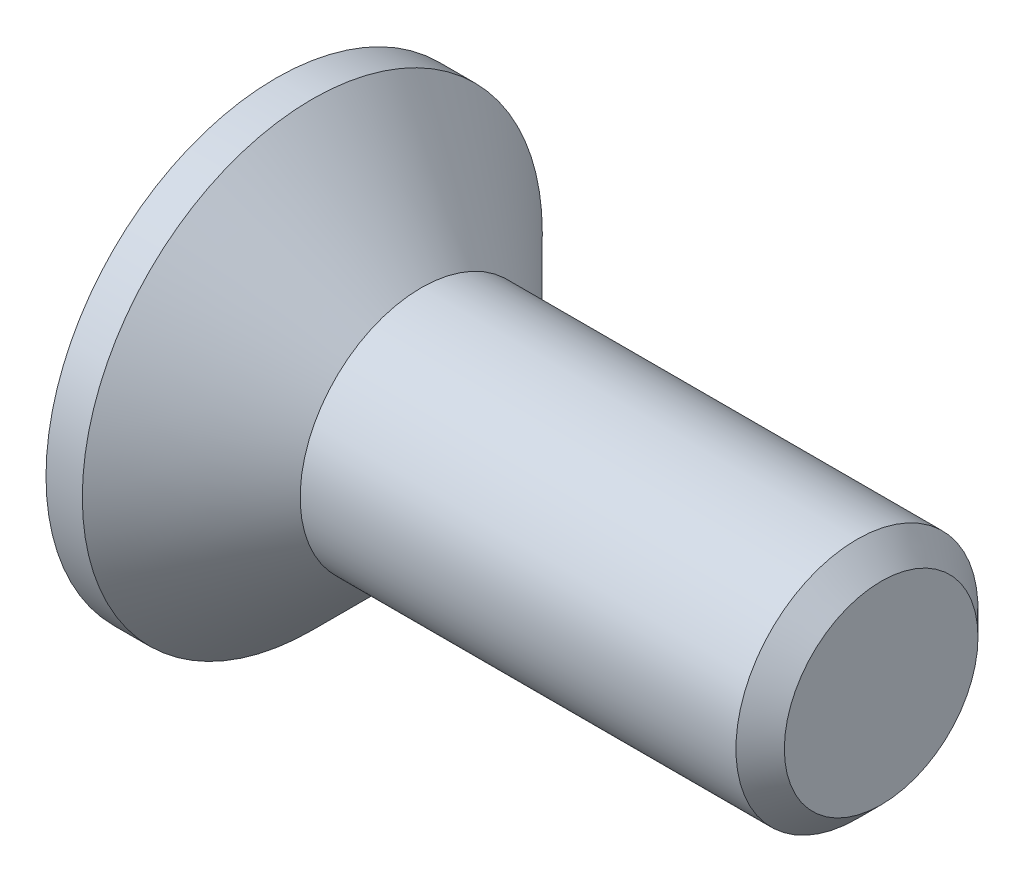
ISO-10303-21;
HEADER;
FILE_DESCRIPTION(('STEP AP214'),'2;1');
FILE_NAME('part.step','',(''),(''),'','','');
FILE_SCHEMA(('AUTOMOTIVE_DESIGN { 1 0 10303 214 1 1 1 1 }'));
ENDSEC;
DATA;
#1=APPLICATION_CONTEXT('core data for automotive mechanical design processes');
#2=APPLICATION_PROTOCOL_DEFINITION('international standard','automotive_design',2000,#1);
#3=PRODUCT_CONTEXT('',#1,'mechanical');
#4=PRODUCT('Part','Part','',(#3));
#5=PRODUCT_RELATED_PRODUCT_CATEGORY('part','',(#4));
#6=PRODUCT_DEFINITION_FORMATION('','',#4);
#7=PRODUCT_DEFINITION_CONTEXT('part definition',#1,'design');
#8=PRODUCT_DEFINITION('design','',#6,#7);
#9=PRODUCT_DEFINITION_SHAPE('','',#8);
#10=(LENGTH_UNIT() NAMED_UNIT(*) SI_UNIT(.MILLI.,.METRE.));
#11=(NAMED_UNIT(*) PLANE_ANGLE_UNIT() SI_UNIT($,.RADIAN.));
#12=(NAMED_UNIT(*) SI_UNIT($,.STERADIAN.) SOLID_ANGLE_UNIT());
#13=UNCERTAINTY_MEASURE_WITH_UNIT(LENGTH_MEASURE(1.E-05),#10,'distance_accuracy_value','');
#14=(GEOMETRIC_REPRESENTATION_CONTEXT(3) GLOBAL_UNCERTAINTY_ASSIGNED_CONTEXT((#13)) GLOBAL_UNIT_ASSIGNED_CONTEXT((#10,
#11,#12)) REPRESENTATION_CONTEXT('',''));
#15=CARTESIAN_POINT('',(0.,0.,0.));
#16=DIRECTION('',(0.,0.,1.));
#17=DIRECTION('',(1.,0.,0.));
#18=AXIS2_PLACEMENT_3D('',#15,#16,#17);
#19=CARTESIAN_POINT('',(0.,0.,0.));
#20=DIRECTION('',(-1.,0.,0.));
#21=DIRECTION('',(0.,-1.,0.));
#22=AXIS2_PLACEMENT_3D('',#19,#20,#21);
#23=CONICAL_SURFACE('',#22,1.,0.78539816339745);
#24=CARTESIAN_POINT('',(-0.899999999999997,0.,0.));
#25=DIRECTION('',(-1.,0.,0.));
#26=DIRECTION('',(0.,-1.,0.));
#27=AXIS2_PLACEMENT_3D('',#24,#25,#26);
#28=CIRCLE('',#27,1.9);
#29=CARTESIAN_POINT('',(-0.899999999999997,-1.9,0.));
#30=VERTEX_POINT('',#29);
#31=EDGE_CURVE('E189',#30,#30,#28,.T.);
#32=ORIENTED_EDGE('',*,*,#31,.F.);
#33=EDGE_LOOP('',(#32));
#34=FACE_BOUND('',#33,.T.);
#35=CARTESIAN_POINT('',(0.,0.,0.));
#36=DIRECTION('',(-1.,0.,0.));
#37=DIRECTION('',(0.,-1.,0.));
#38=AXIS2_PLACEMENT_3D('',#35,#36,#37);
#39=CIRCLE('',#38,1.);
#40=CARTESIAN_POINT('',(0.,-1.,0.));
#41=VERTEX_POINT('',#40);
#42=EDGE_CURVE('E212',#41,#41,#39,.T.);
#43=ORIENTED_EDGE('',*,*,#42,.T.);
#44=EDGE_LOOP('',(#43));
#45=FACE_BOUND('',#44,.T.);
#46=ADVANCED_FACE('F33',(#34,#45),#23,.T.);
#47=CARTESIAN_POINT('',(-1.2,0.,0.));
#48=DIRECTION('',(-1.,0.,0.));
#49=DIRECTION('',(0.,-1.,0.));
#50=AXIS2_PLACEMENT_3D('',#47,#48,#49);
#51=CYLINDRICAL_SURFACE('',#50,1.);
#52=CARTESIAN_POINT('',(3.6,0.,0.));
#53=DIRECTION('',(-1.,0.,0.));
#54=DIRECTION('',(0.,-1.,0.));
#55=AXIS2_PLACEMENT_3D('',#52,#53,#54);
#56=CIRCLE('',#55,1.);
#57=CARTESIAN_POINT('',(3.6,-1.,0.));
#58=VERTEX_POINT('',#57);
#59=EDGE_CURVE('E41',#58,#58,#56,.T.);
#60=ORIENTED_EDGE('',*,*,#59,.T.);
#61=EDGE_LOOP('',(#60));
#62=FACE_BOUND('',#61,.T.);
#63=ORIENTED_EDGE('',*,*,#42,.F.);
#64=EDGE_LOOP('',(#63));
#65=FACE_BOUND('',#64,.T.);
#66=ADVANCED_FACE('F217',(#62,#65),#51,.T.);
#67=CARTESIAN_POINT('',(3.8,0.,0.));
#68=DIRECTION('',(-1.,0.,0.));
#69=DIRECTION('',(0.,-1.,0.));
#70=AXIS2_PLACEMENT_3D('',#67,#68,#69);
#71=PLANE('',#70);
#72=CARTESIAN_POINT('',(3.8,0.,0.));
#73=DIRECTION('',(-1.,0.,0.));
#74=DIRECTION('',(0.,-1.,0.));
#75=AXIS2_PLACEMENT_3D('',#72,#73,#74);
#76=CIRCLE('',#75,0.799999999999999);
#77=CARTESIAN_POINT('',(3.8,-0.799999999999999,0.));
#78=VERTEX_POINT('',#77);
#79=EDGE_CURVE('E11',#78,#78,#76,.F.);
#80=ORIENTED_EDGE('',*,*,#79,.T.);
#81=EDGE_LOOP('',(#80));
#82=FACE_BOUND('',#81,.T.);
#83=ADVANCED_FACE('F239',(#82),#71,.F.);
#84=CARTESIAN_POINT('',(-1.2,1.9,0.));
#85=DIRECTION('',(1.,0.,0.));
#86=DIRECTION('',(0.,1.,0.));
#87=AXIS2_PLACEMENT_3D('',#84,#85,#86);
#88=PLANE('',#87);
#89=DIRECTION('',(0.,0.,-1.));
#90=VECTOR('',#89,1.);
#91=CARTESIAN_POINT('',(-1.2,0.3,-1.175));
#92=LINE('',#91,#90);
#93=CARTESIAN_POINT('',(-1.2,0.3,-0.3));
#94=VERTEX_POINT('',#93);
#95=CARTESIAN_POINT('',(-1.2,0.3,-1.175));
#96=VERTEX_POINT('',#95);
#97=EDGE_CURVE('E158',#94,#96,#92,.T.);
#98=ORIENTED_EDGE('',*,*,#97,.F.);
#99=DIRECTION('',(0.,-1.,0.));
#100=VECTOR('',#99,1.);
#101=CARTESIAN_POINT('',(-1.2,0.3,-0.3));
#102=LINE('',#101,#100);
#103=CARTESIAN_POINT('',(-1.2,1.175,-0.3));
#104=VERTEX_POINT('',#103);
#105=EDGE_CURVE('E48',#104,#94,#102,.T.);
#106=ORIENTED_EDGE('',*,*,#105,.F.);
#107=DIRECTION('',(0.,0.,-1.));
#108=VECTOR('',#107,1.);
#109=CARTESIAN_POINT('',(-1.2,1.175,-0.3));
#110=LINE('',#109,#108);
#111=CARTESIAN_POINT('',(-1.2,1.175,0.3));
#112=VERTEX_POINT('',#111);
#113=EDGE_CURVE('E185',#112,#104,#110,.T.);
#114=ORIENTED_EDGE('',*,*,#113,.F.);
#115=DIRECTION('',(0.,1.,0.));
#116=VECTOR('',#115,1.);
#117=CARTESIAN_POINT('',(-1.2,1.175,0.3));
#118=LINE('',#117,#116);
#119=CARTESIAN_POINT('',(-1.2,0.3,0.3));
#120=VERTEX_POINT('',#119);
#121=EDGE_CURVE('E183',#120,#112,#118,.T.);
#122=ORIENTED_EDGE('',*,*,#121,.F.);
#123=DIRECTION('',(0.,0.,-1.));
#124=VECTOR('',#123,1.);
#125=CARTESIAN_POINT('',(-1.2,0.3,0.3));
#126=LINE('',#125,#124);
#127=CARTESIAN_POINT('',(-1.2,0.3,1.175));
#128=VERTEX_POINT('',#127);
#129=EDGE_CURVE('E132',#128,#120,#126,.T.);
#130=ORIENTED_EDGE('',*,*,#129,.F.);
#131=DIRECTION('',(0.,1.,0.));
#132=VECTOR('',#131,1.);
#133=CARTESIAN_POINT('',(-1.2,0.3,1.175));
#134=LINE('',#133,#132);
#135=CARTESIAN_POINT('',(-1.2,-0.3,1.175));
#136=VERTEX_POINT('',#135);
#137=EDGE_CURVE('E179',#136,#128,#134,.T.);
#138=ORIENTED_EDGE('',*,*,#137,.F.);
#139=DIRECTION('',(0.,0.,1.));
#140=VECTOR('',#139,1.);
#141=CARTESIAN_POINT('',(-1.2,-0.3,1.175));
#142=LINE('',#141,#140);
#143=CARTESIAN_POINT('',(-1.2,-0.3,0.3));
#144=VERTEX_POINT('',#143);
#145=EDGE_CURVE('E176',#144,#136,#142,.T.);
#146=ORIENTED_EDGE('',*,*,#145,.F.);
#147=DIRECTION('',(0.,1.,0.));
#148=VECTOR('',#147,1.);
#149=CARTESIAN_POINT('',(-1.2,-0.3,0.3));
#150=LINE('',#149,#148);
#151=CARTESIAN_POINT('',(-1.2,-1.175,0.3));
#152=VERTEX_POINT('',#151);
#153=EDGE_CURVE('E173',#152,#144,#150,.T.);
#154=ORIENTED_EDGE('',*,*,#153,.F.);
#155=DIRECTION('',(0.,0.,1.));
#156=VECTOR('',#155,1.);
#157=CARTESIAN_POINT('',(-1.2,-1.175,0.3));
#158=LINE('',#157,#156);
#159=CARTESIAN_POINT('',(-1.2,-1.175,-0.3));
#160=VERTEX_POINT('',#159);
#161=EDGE_CURVE('E170',#160,#152,#158,.T.);
#162=ORIENTED_EDGE('',*,*,#161,.F.);
#163=DIRECTION('',(0.,-1.,0.));
#164=VECTOR('',#163,1.);
#165=CARTESIAN_POINT('',(-1.2,-1.175,-0.3));
#166=LINE('',#165,#164);
#167=CARTESIAN_POINT('',(-1.2,-0.3,-0.3));
#168=VERTEX_POINT('',#167);
#169=EDGE_CURVE('E167',#168,#160,#166,.T.);
#170=ORIENTED_EDGE('',*,*,#169,.F.);
#171=DIRECTION('',(0.,0.,1.));
#172=VECTOR('',#171,1.);
#173=CARTESIAN_POINT('',(-1.2,-0.3,-0.3));
#174=LINE('',#173,#172);
#175=CARTESIAN_POINT('',(-1.2,-0.3,-1.175));
#176=VERTEX_POINT('',#175);
#177=EDGE_CURVE('E164',#176,#168,#174,.T.);
#178=ORIENTED_EDGE('',*,*,#177,.F.);
#179=DIRECTION('',(0.,-1.,0.));
#180=VECTOR('',#179,1.);
#181=CARTESIAN_POINT('',(-1.2,-0.3,-1.175));
#182=LINE('',#181,#180);
#183=EDGE_CURVE('E161',#96,#176,#182,.T.);
#184=ORIENTED_EDGE('',*,*,#183,.F.);
#185=EDGE_LOOP('',(#98,#106,#114,#122,#130,#138,#146,#154,#162,#170,#178,#184));
#186=FACE_BOUND('',#185,.T.);
#187=CARTESIAN_POINT('',(-1.2,0.,0.));
#188=DIRECTION('',(-1.,0.,0.));
#189=DIRECTION('',(0.,-1.,0.));
#190=AXIS2_PLACEMENT_3D('',#187,#188,#189);
#191=CIRCLE('',#190,1.9);
#192=CARTESIAN_POINT('',(-1.2,-1.9,0.));
#193=VERTEX_POINT('',#192);
#194=EDGE_CURVE('E209',#193,#193,#191,.T.);
#195=ORIENTED_EDGE('',*,*,#194,.T.);
#196=EDGE_LOOP('',(#195));
#197=FACE_BOUND('',#196,.T.);
#198=ADVANCED_FACE('F230',(#186,#197),#88,.F.);
#199=CARTESIAN_POINT('',(-1.2,0.,0.));
#200=DIRECTION('',(-1.,0.,0.));
#201=DIRECTION('',(0.,-1.,0.));
#202=AXIS2_PLACEMENT_3D('',#199,#200,#201);
#203=CYLINDRICAL_SURFACE('',#202,1.9);
#204=ORIENTED_EDGE('',*,*,#194,.F.);
#205=EDGE_LOOP('',(#204));
#206=FACE_BOUND('',#205,.T.);
#207=ORIENTED_EDGE('',*,*,#31,.T.);
#208=EDGE_LOOP('',(#207));
#209=FACE_BOUND('',#208,.T.);
#210=ADVANCED_FACE('F222',(#206,#209),#203,.T.);
#211=CARTESIAN_POINT('',(3.6,0.,0.));
#212=DIRECTION('',(-1.,0.,0.));
#213=DIRECTION('',(0.,-1.,0.));
#214=AXIS2_PLACEMENT_3D('',#211,#212,#213);
#215=CONICAL_SURFACE('',#214,1.,0.78539816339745);
#216=ORIENTED_EDGE('',*,*,#79,.F.);
#217=EDGE_LOOP('',(#216));
#218=FACE_BOUND('',#217,.T.);
#219=ORIENTED_EDGE('',*,*,#59,.F.);
#220=EDGE_LOOP('',(#219));
#221=FACE_BOUND('',#220,.T.);
#222=ADVANCED_FACE('F35',(#218,#221),#215,.T.);
#223=CARTESIAN_POINT('',(-0.249999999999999,0.3,-0.3));
#224=DIRECTION('',(0.,0.,-1.));
#225=DIRECTION('',(0.,1.,0.));
#226=AXIS2_PLACEMENT_3D('',#223,#224,#225);
#227=PLANE('',#226);
#228=ORIENTED_EDGE('',*,*,#105,.T.);
#229=DIRECTION('',(-1.,0.,0.));
#230=VECTOR('',#229,1.);
#231=CARTESIAN_POINT('',(-0.249999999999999,0.3,-0.3));
#232=LINE('',#231,#230);
#233=CARTESIAN_POINT('',(-0.249999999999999,0.3,-0.3));
#234=VERTEX_POINT('',#233);
#235=EDGE_CURVE('E96',#234,#94,#232,.T.);
#236=ORIENTED_EDGE('',*,*,#235,.F.);
#237=DIRECTION('',(0.,-1.,0.));
#238=VECTOR('',#237,1.);
#239=CARTESIAN_POINT('',(-0.249999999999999,0.3,-0.3));
#240=LINE('',#239,#238);
#241=CARTESIAN_POINT('',(-0.249999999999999,1.175,-0.3));
#242=VERTEX_POINT('',#241);
#243=EDGE_CURVE('E187',#242,#234,#240,.T.);
#244=ORIENTED_EDGE('',*,*,#243,.F.);
#245=DIRECTION('',(-1.,0.,0.));
#246=VECTOR('',#245,1.);
#247=CARTESIAN_POINT('',(-0.249999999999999,1.175,-0.3));
#248=LINE('',#247,#246);
#249=EDGE_CURVE('E56',#242,#104,#248,.T.);
#250=ORIENTED_EDGE('',*,*,#249,.T.);
#251=EDGE_LOOP('',(#228,#236,#244,#250));
#252=FACE_BOUND('',#251,.T.);
#253=ADVANCED_FACE('F221',(#252),#227,.F.);
#254=CARTESIAN_POINT('',(-0.249999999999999,1.175,-0.3));
#255=DIRECTION('',(0.,1.,0.));
#256=DIRECTION('',(-1.,0.,0.));
#257=AXIS2_PLACEMENT_3D('',#254,#255,#256);
#258=PLANE('',#257);
#259=ORIENTED_EDGE('',*,*,#113,.T.);
#260=ORIENTED_EDGE('',*,*,#249,.F.);
#261=DIRECTION('',(0.,0.,-1.));
#262=VECTOR('',#261,1.);
#263=CARTESIAN_POINT('',(-0.249999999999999,1.175,-0.3));
#264=LINE('',#263,#262);
#265=CARTESIAN_POINT('',(-0.249999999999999,1.175,0.3));
#266=VERTEX_POINT('',#265);
#267=EDGE_CURVE('E144',#266,#242,#264,.T.);
#268=ORIENTED_EDGE('',*,*,#267,.F.);
#269=DIRECTION('',(-1.,0.,0.));
#270=VECTOR('',#269,1.);
#271=CARTESIAN_POINT('',(-0.249999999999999,1.175,0.3));
#272=LINE('',#271,#270);
#273=EDGE_CURVE('E136',#266,#112,#272,.T.);
#274=ORIENTED_EDGE('',*,*,#273,.T.);
#275=EDGE_LOOP('',(#259,#260,#268,#274));
#276=FACE_BOUND('',#275,.T.);
#277=ADVANCED_FACE('F228',(#276),#258,.F.);
#278=CARTESIAN_POINT('',(-0.249999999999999,1.175,0.3));
#279=DIRECTION('',(0.,0.,1.));
#280=DIRECTION('',(0.,-1.,0.));
#281=AXIS2_PLACEMENT_3D('',#278,#279,#280);
#282=PLANE('',#281);
#283=ORIENTED_EDGE('',*,*,#121,.T.);
#284=ORIENTED_EDGE('',*,*,#273,.F.);
#285=DIRECTION('',(0.,1.,0.));
#286=VECTOR('',#285,1.);
#287=CARTESIAN_POINT('',(-0.249999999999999,1.175,0.3));
#288=LINE('',#287,#286);
#289=CARTESIAN_POINT('',(-0.249999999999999,0.3,0.3));
#290=VERTEX_POINT('',#289);
#291=EDGE_CURVE('E140',#290,#266,#288,.T.);
#292=ORIENTED_EDGE('',*,*,#291,.F.);
#293=DIRECTION('',(-1.,0.,0.));
#294=VECTOR('',#293,1.);
#295=CARTESIAN_POINT('',(-0.249999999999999,0.3,0.3));
#296=LINE('',#295,#294);
#297=EDGE_CURVE('E125',#290,#120,#296,.T.);
#298=ORIENTED_EDGE('',*,*,#297,.T.);
#299=EDGE_LOOP('',(#283,#284,#292,#298));
#300=FACE_BOUND('',#299,.T.);
#301=ADVANCED_FACE('F141',(#300),#282,.F.);
#302=CARTESIAN_POINT('',(-0.249999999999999,0.3,0.3));
#303=DIRECTION('',(0.,1.,0.));
#304=DIRECTION('',(0.,0.,1.));
#305=AXIS2_PLACEMENT_3D('',#302,#303,#304);
#306=PLANE('',#305);
#307=ORIENTED_EDGE('',*,*,#129,.T.);
#308=ORIENTED_EDGE('',*,*,#297,.F.);
#309=DIRECTION('',(0.,0.,-1.));
#310=VECTOR('',#309,1.);
#311=CARTESIAN_POINT('',(-0.249999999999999,0.3,0.3));
#312=LINE('',#311,#310);
#313=CARTESIAN_POINT('',(-0.249999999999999,0.3,1.175));
#314=VERTEX_POINT('',#313);
#315=EDGE_CURVE('E129',#314,#290,#312,.T.);
#316=ORIENTED_EDGE('',*,*,#315,.F.);
#317=DIRECTION('',(-1.,0.,0.));
#318=VECTOR('',#317,1.);
#319=CARTESIAN_POINT('',(-0.249999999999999,0.3,1.175));
#320=LINE('',#319,#318);
#321=EDGE_CURVE('E137',#314,#128,#320,.T.);
#322=ORIENTED_EDGE('',*,*,#321,.T.);
#323=EDGE_LOOP('',(#307,#308,#316,#322));
#324=FACE_BOUND('',#323,.T.);
#325=ADVANCED_FACE('F127',(#324),#306,.F.);
#326=CARTESIAN_POINT('',(-0.249999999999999,0.3,1.175));
#327=DIRECTION('',(0.,0.,1.));
#328=DIRECTION('',(1.,0.,0.));
#329=AXIS2_PLACEMENT_3D('',#326,#327,#328);
#330=PLANE('',#329);
#331=ORIENTED_EDGE('',*,*,#137,.T.);
#332=ORIENTED_EDGE('',*,*,#321,.F.);
#333=DIRECTION('',(0.,1.,0.));
#334=VECTOR('',#333,1.);
#335=CARTESIAN_POINT('',(-0.249999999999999,0.3,1.175));
#336=LINE('',#335,#334);
#337=CARTESIAN_POINT('',(-0.249999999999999,-0.3,1.175));
#338=VERTEX_POINT('',#337);
#339=EDGE_CURVE('E150',#338,#314,#336,.T.);
#340=ORIENTED_EDGE('',*,*,#339,.F.);
#341=DIRECTION('',(-1.,0.,0.));
#342=VECTOR('',#341,1.);
#343=CARTESIAN_POINT('',(-0.249999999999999,-0.3,1.175));
#344=LINE('',#343,#342);
#345=EDGE_CURVE('E192',#338,#136,#344,.T.);
#346=ORIENTED_EDGE('',*,*,#345,.T.);
#347=EDGE_LOOP('',(#331,#332,#340,#346));
#348=FACE_BOUND('',#347,.T.);
#349=ADVANCED_FACE('F277',(#348),#330,.F.);
#350=CARTESIAN_POINT('',(-0.249999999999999,-0.3,1.175));
#351=DIRECTION('',(0.,-1.,0.));
#352=DIRECTION('',(0.,0.,-1.));
#353=AXIS2_PLACEMENT_3D('',#350,#351,#352);
#354=PLANE('',#353);
#355=ORIENTED_EDGE('',*,*,#145,.T.);
#356=ORIENTED_EDGE('',*,*,#345,.F.);
#357=DIRECTION('',(0.,0.,1.));
#358=VECTOR('',#357,1.);
#359=CARTESIAN_POINT('',(-0.249999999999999,-0.3,1.175));
#360=LINE('',#359,#358);
#361=CARTESIAN_POINT('',(-0.249999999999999,-0.3,0.3));
#362=VERTEX_POINT('',#361);
#363=EDGE_CURVE('E152',#362,#338,#360,.T.);
#364=ORIENTED_EDGE('',*,*,#363,.F.);
#365=DIRECTION('',(-1.,0.,0.));
#366=VECTOR('',#365,1.);
#367=CARTESIAN_POINT('',(-0.249999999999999,-0.3,0.3));
#368=LINE('',#367,#366);
#369=EDGE_CURVE('E194',#362,#144,#368,.T.);
#370=ORIENTED_EDGE('',*,*,#369,.T.);
#371=EDGE_LOOP('',(#355,#356,#364,#370));
#372=FACE_BOUND('',#371,.T.);
#373=ADVANCED_FACE('F273',(#372),#354,.F.);
#374=CARTESIAN_POINT('',(-0.249999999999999,-0.3,0.3));
#375=DIRECTION('',(0.,0.,1.));
#376=DIRECTION('',(1.,0.,0.));
#377=AXIS2_PLACEMENT_3D('',#374,#375,#376);
#378=PLANE('',#377);
#379=ORIENTED_EDGE('',*,*,#153,.T.);
#380=ORIENTED_EDGE('',*,*,#369,.F.);
#381=DIRECTION('',(0.,1.,0.));
#382=VECTOR('',#381,1.);
#383=CARTESIAN_POINT('',(-0.249999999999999,-0.3,0.3));
#384=LINE('',#383,#382);
#385=CARTESIAN_POINT('',(-0.249999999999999,-1.175,0.3));
#386=VERTEX_POINT('',#385);
#387=EDGE_CURVE('E422',#386,#362,#384,.T.);
#388=ORIENTED_EDGE('',*,*,#387,.F.);
#389=DIRECTION('',(-1.,0.,0.));
#390=VECTOR('',#389,1.);
#391=CARTESIAN_POINT('',(-0.249999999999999,-1.175,0.3));
#392=LINE('',#391,#390);
#393=EDGE_CURVE('E196',#386,#152,#392,.T.);
#394=ORIENTED_EDGE('',*,*,#393,.T.);
#395=EDGE_LOOP('',(#379,#380,#388,#394));
#396=FACE_BOUND('',#395,.T.);
#397=ADVANCED_FACE('F269',(#396),#378,.F.);
#398=CARTESIAN_POINT('',(-0.249999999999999,-1.175,0.3));
#399=DIRECTION('',(0.,-1.,0.));
#400=DIRECTION('',(1.,0.,0.));
#401=AXIS2_PLACEMENT_3D('',#398,#399,#400);
#402=PLANE('',#401);
#403=ORIENTED_EDGE('',*,*,#161,.T.);
#404=ORIENTED_EDGE('',*,*,#393,.F.);
#405=DIRECTION('',(0.,0.,1.));
#406=VECTOR('',#405,1.);
#407=CARTESIAN_POINT('',(-0.249999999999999,-1.175,0.3));
#408=LINE('',#407,#406);
#409=CARTESIAN_POINT('',(-0.249999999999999,-1.175,-0.3));
#410=VERTEX_POINT('',#409);
#411=EDGE_CURVE('E419',#410,#386,#408,.T.);
#412=ORIENTED_EDGE('',*,*,#411,.F.);
#413=DIRECTION('',(-1.,0.,0.));
#414=VECTOR('',#413,1.);
#415=CARTESIAN_POINT('',(-0.249999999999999,-1.175,-0.3));
#416=LINE('',#415,#414);
#417=EDGE_CURVE('E198',#410,#160,#416,.T.);
#418=ORIENTED_EDGE('',*,*,#417,.T.);
#419=EDGE_LOOP('',(#403,#404,#412,#418));
#420=FACE_BOUND('',#419,.T.);
#421=ADVANCED_FACE('F265',(#420),#402,.F.);
#422=CARTESIAN_POINT('',(-0.249999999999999,-1.175,-0.3));
#423=DIRECTION('',(0.,0.,-1.));
#424=DIRECTION('',(0.,1.,0.));
#425=AXIS2_PLACEMENT_3D('',#422,#423,#424);
#426=PLANE('',#425);
#427=ORIENTED_EDGE('',*,*,#169,.T.);
#428=ORIENTED_EDGE('',*,*,#417,.F.);
#429=DIRECTION('',(0.,-1.,0.));
#430=VECTOR('',#429,1.);
#431=CARTESIAN_POINT('',(-0.249999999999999,-1.175,-0.3));
#432=LINE('',#431,#430);
#433=CARTESIAN_POINT('',(-0.249999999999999,-0.3,-0.3));
#434=VERTEX_POINT('',#433);
#435=EDGE_CURVE('E416',#434,#410,#432,.T.);
#436=ORIENTED_EDGE('',*,*,#435,.F.);
#437=DIRECTION('',(-1.,0.,0.));
#438=VECTOR('',#437,1.);
#439=CARTESIAN_POINT('',(-0.249999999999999,-0.3,-0.3));
#440=LINE('',#439,#438);
#441=EDGE_CURVE('E200',#434,#168,#440,.T.);
#442=ORIENTED_EDGE('',*,*,#441,.T.);
#443=EDGE_LOOP('',(#427,#428,#436,#442));
#444=FACE_BOUND('',#443,.T.);
#445=ADVANCED_FACE('F261',(#444),#426,.F.);
#446=CARTESIAN_POINT('',(-0.249999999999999,-0.3,-0.3));
#447=DIRECTION('',(0.,-1.,0.));
#448=DIRECTION('',(0.,0.,-1.));
#449=AXIS2_PLACEMENT_3D('',#446,#447,#448);
#450=PLANE('',#449);
#451=ORIENTED_EDGE('',*,*,#177,.T.);
#452=ORIENTED_EDGE('',*,*,#441,.F.);
#453=DIRECTION('',(0.,0.,1.));
#454=VECTOR('',#453,1.);
#455=CARTESIAN_POINT('',(-0.249999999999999,-0.3,-0.3));
#456=LINE('',#455,#454);
#457=CARTESIAN_POINT('',(-0.249999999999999,-0.3,-1.175));
#458=VERTEX_POINT('',#457);
#459=EDGE_CURVE('E413',#458,#434,#456,.T.);
#460=ORIENTED_EDGE('',*,*,#459,.F.);
#461=DIRECTION('',(-1.,0.,0.));
#462=VECTOR('',#461,1.);
#463=CARTESIAN_POINT('',(-0.249999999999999,-0.3,-1.175));
#464=LINE('',#463,#462);
#465=EDGE_CURVE('E202',#458,#176,#464,.T.);
#466=ORIENTED_EDGE('',*,*,#465,.T.);
#467=EDGE_LOOP('',(#451,#452,#460,#466));
#468=FACE_BOUND('',#467,.T.);
#469=ADVANCED_FACE('F257',(#468),#450,.F.);
#470=CARTESIAN_POINT('',(-0.249999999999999,-0.3,-1.175));
#471=DIRECTION('',(0.,0.,-1.));
#472=DIRECTION('',(-1.,0.,0.));
#473=AXIS2_PLACEMENT_3D('',#470,#471,#472);
#474=PLANE('',#473);
#475=ORIENTED_EDGE('',*,*,#183,.T.);
#476=ORIENTED_EDGE('',*,*,#465,.F.);
#477=DIRECTION('',(0.,-1.,0.));
#478=VECTOR('',#477,1.);
#479=CARTESIAN_POINT('',(-0.249999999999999,-0.3,-1.175));
#480=LINE('',#479,#478);
#481=CARTESIAN_POINT('',(-0.249999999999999,0.3,-1.175));
#482=VERTEX_POINT('',#481);
#483=EDGE_CURVE('E408',#482,#458,#480,.T.);
#484=ORIENTED_EDGE('',*,*,#483,.F.);
#485=DIRECTION('',(-1.,0.,0.));
#486=VECTOR('',#485,1.);
#487=CARTESIAN_POINT('',(-0.249999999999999,0.3,-1.175));
#488=LINE('',#487,#486);
#489=EDGE_CURVE('E204',#482,#96,#488,.T.);
#490=ORIENTED_EDGE('',*,*,#489,.T.);
#491=EDGE_LOOP('',(#475,#476,#484,#490));
#492=FACE_BOUND('',#491,.T.);
#493=ADVANCED_FACE('F253',(#492),#474,.F.);
#494=CARTESIAN_POINT('',(-0.249999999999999,0.3,-1.175));
#495=DIRECTION('',(0.,1.,0.));
#496=DIRECTION('',(0.,0.,1.));
#497=AXIS2_PLACEMENT_3D('',#494,#495,#496);
#498=PLANE('',#497);
#499=ORIENTED_EDGE('',*,*,#97,.T.);
#500=ORIENTED_EDGE('',*,*,#489,.F.);
#501=DIRECTION('',(0.,0.,-1.));
#502=VECTOR('',#501,1.);
#503=CARTESIAN_POINT('',(-0.249999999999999,0.3,-1.175));
#504=LINE('',#503,#502);
#505=EDGE_CURVE('E406',#234,#482,#504,.T.);
#506=ORIENTED_EDGE('',*,*,#505,.F.);
#507=ORIENTED_EDGE('',*,*,#235,.T.);
#508=EDGE_LOOP('',(#499,#500,#506,#507));
#509=FACE_BOUND('',#508,.T.);
#510=ADVANCED_FACE('F250',(#509),#498,.F.);
#511=CARTESIAN_POINT('',(-0.249999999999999,0.,0.));
#512=DIRECTION('',(1.,0.,0.));
#513=DIRECTION('',(0.,0.,-1.));
#514=AXIS2_PLACEMENT_3D('',#511,#512,#513);
#515=PLANE('',#514);
#516=ORIENTED_EDGE('',*,*,#243,.T.);
#517=ORIENTED_EDGE('',*,*,#505,.T.);
#518=ORIENTED_EDGE('',*,*,#483,.T.);
#519=ORIENTED_EDGE('',*,*,#459,.T.);
#520=ORIENTED_EDGE('',*,*,#435,.T.);
#521=ORIENTED_EDGE('',*,*,#411,.T.);
#522=ORIENTED_EDGE('',*,*,#387,.T.);
#523=ORIENTED_EDGE('',*,*,#363,.T.);
#524=ORIENTED_EDGE('',*,*,#339,.T.);
#525=ORIENTED_EDGE('',*,*,#315,.T.);
#526=ORIENTED_EDGE('',*,*,#291,.T.);
#527=ORIENTED_EDGE('',*,*,#267,.T.);
#528=EDGE_LOOP('',(#516,#517,#518,#519,#520,#521,#522,#523,#524,#525,#526,#527));
#529=FACE_BOUND('',#528,.T.);
#530=ADVANCED_FACE('F147',(#529),#515,.F.);
#531=CLOSED_SHELL('',(#46,#66,#83,#198,#210,#222,#253,#277,#301,#325,#349,#373,#397,#421,#445,
#469,#493,#510,#530));
#532=MANIFOLD_SOLID_BREP('B2',#531);
#533=ADVANCED_BREP_SHAPE_REPRESENTATION('',(#18,#532),#14);
#534=SHAPE_DEFINITION_REPRESENTATION(#9,#533);
ENDSEC;
END-ISO-10303-21;
